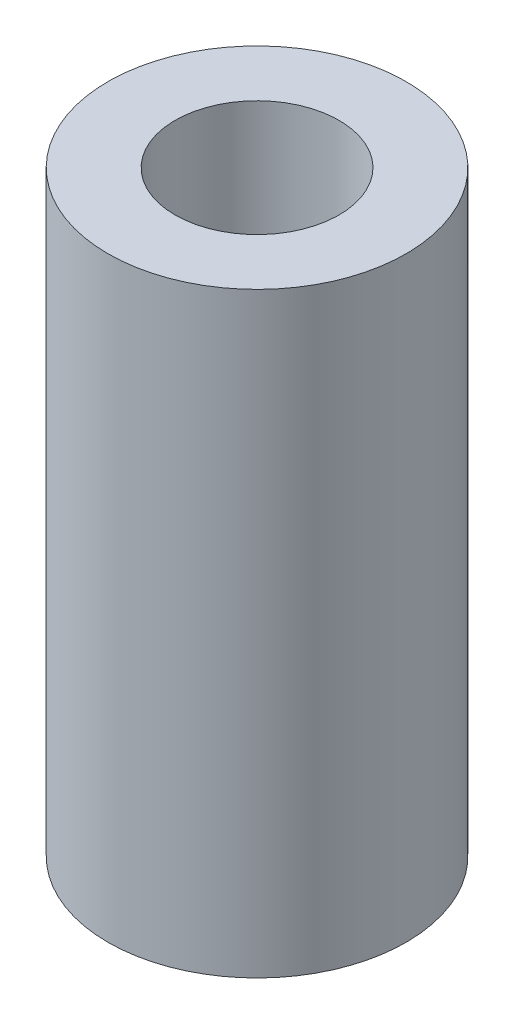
ISO-10303-21;
HEADER;
FILE_DESCRIPTION(('STEP AP214'),'2;1');
FILE_NAME('part.step','',(''),(''),'','','');
FILE_SCHEMA(('AUTOMOTIVE_DESIGN { 1 0 10303 214 1 1 1 1 }'));
ENDSEC;
DATA;
#1=APPLICATION_CONTEXT('core data for automotive mechanical design processes');
#2=APPLICATION_PROTOCOL_DEFINITION('international standard','automotive_design',2000,#1);
#3=PRODUCT_CONTEXT('',#1,'mechanical');
#4=PRODUCT('Part','Part','',(#3));
#5=PRODUCT_RELATED_PRODUCT_CATEGORY('part','',(#4));
#6=PRODUCT_DEFINITION_FORMATION('','',#4);
#7=PRODUCT_DEFINITION_CONTEXT('part definition',#1,'design');
#8=PRODUCT_DEFINITION('design','',#6,#7);
#9=PRODUCT_DEFINITION_SHAPE('','',#8);
#10=(LENGTH_UNIT() NAMED_UNIT(*) SI_UNIT(.MILLI.,.METRE.));
#11=(NAMED_UNIT(*) PLANE_ANGLE_UNIT() SI_UNIT($,.RADIAN.));
#12=(NAMED_UNIT(*) SI_UNIT($,.STERADIAN.) SOLID_ANGLE_UNIT());
#13=UNCERTAINTY_MEASURE_WITH_UNIT(LENGTH_MEASURE(1.E-05),#10,'distance_accuracy_value','');
#14=(GEOMETRIC_REPRESENTATION_CONTEXT(3) GLOBAL_UNCERTAINTY_ASSIGNED_CONTEXT((#13)) GLOBAL_UNIT_ASSIGNED_CONTEXT((#10,
#11,#12)) REPRESENTATION_CONTEXT('',''));
#15=CARTESIAN_POINT('',(0.,0.,0.));
#16=DIRECTION('',(0.,0.,1.));
#17=DIRECTION('',(1.,0.,0.));
#18=AXIS2_PLACEMENT_3D('',#15,#16,#17);
#19=CARTESIAN_POINT('',(0.,20.,0.));
#20=DIRECTION('',(0.,1.,0.));
#21=DIRECTION('',(0.,0.,1.));
#22=AXIS2_PLACEMENT_3D('',#19,#20,#21);
#23=PLANE('',#22);
#24=CARTESIAN_POINT('',(0.,20.,0.));
#25=DIRECTION('',(0.,1.,0.));
#26=DIRECTION('',(0.,0.,1.));
#27=AXIS2_PLACEMENT_3D('',#24,#25,#26);
#28=CIRCLE('',#27,5.);
#29=CARTESIAN_POINT('',(0.,20.,5.));
#30=VERTEX_POINT('',#29);
#31=EDGE_CURVE('E10',#30,#30,#28,.T.);
#32=ORIENTED_EDGE('',*,*,#31,.T.);
#33=EDGE_LOOP('',(#32));
#34=FACE_BOUND('',#33,.T.);
#35=CARTESIAN_POINT('',(0.,20.,0.));
#36=DIRECTION('',(0.,1.,0.));
#37=DIRECTION('',(0.,0.,1.));
#38=AXIS2_PLACEMENT_3D('',#35,#36,#37);
#39=CIRCLE('',#38,2.75);
#40=CARTESIAN_POINT('',(0.,20.,2.75));
#41=VERTEX_POINT('',#40);
#42=EDGE_CURVE('E43',#41,#41,#39,.T.);
#43=ORIENTED_EDGE('',*,*,#42,.F.);
#44=EDGE_LOOP('',(#43));
#45=FACE_BOUND('',#44,.T.);
#46=ADVANCED_FACE('F32',(#34,#45),#23,.T.);
#47=CARTESIAN_POINT('',(0.,0.,0.));
#48=DIRECTION('',(0.,1.,0.));
#49=DIRECTION('',(0.,0.,1.));
#50=AXIS2_PLACEMENT_3D('',#47,#48,#49);
#51=PLANE('',#50);
#52=CARTESIAN_POINT('',(0.,0.,0.));
#53=DIRECTION('',(0.,1.,0.));
#54=DIRECTION('',(0.,0.,1.));
#55=AXIS2_PLACEMENT_3D('',#52,#53,#54);
#56=CIRCLE('',#55,5.);
#57=CARTESIAN_POINT('',(0.,0.,5.));
#58=VERTEX_POINT('',#57);
#59=EDGE_CURVE('E36',#58,#58,#56,.T.);
#60=ORIENTED_EDGE('',*,*,#59,.F.);
#61=EDGE_LOOP('',(#60));
#62=FACE_BOUND('',#61,.T.);
#63=CARTESIAN_POINT('',(0.,0.,0.));
#64=DIRECTION('',(0.,1.,0.));
#65=DIRECTION('',(0.,0.,1.));
#66=AXIS2_PLACEMENT_3D('',#63,#64,#65);
#67=CIRCLE('',#66,2.75);
#68=CARTESIAN_POINT('',(0.,0.,2.75));
#69=VERTEX_POINT('',#68);
#70=EDGE_CURVE('E45',#69,#69,#67,.T.);
#71=ORIENTED_EDGE('',*,*,#70,.T.);
#72=EDGE_LOOP('',(#71));
#73=FACE_BOUND('',#72,.T.);
#74=ADVANCED_FACE('F55',(#62,#73),#51,.F.);
#75=CARTESIAN_POINT('',(0.,20.,0.));
#76=DIRECTION('',(0.,-1.,0.));
#77=DIRECTION('',(0.,0.,-1.));
#78=AXIS2_PLACEMENT_3D('',#75,#76,#77);
#79=CYLINDRICAL_SURFACE('',#78,5.);
#80=ORIENTED_EDGE('',*,*,#31,.F.);
#81=EDGE_LOOP('',(#80));
#82=FACE_BOUND('',#81,.T.);
#83=ORIENTED_EDGE('',*,*,#59,.T.);
#84=EDGE_LOOP('',(#83));
#85=FACE_BOUND('',#84,.T.);
#86=ADVANCED_FACE('F34',(#82,#85),#79,.T.);
#87=CARTESIAN_POINT('',(0.,20.,0.));
#88=DIRECTION('',(0.,-1.,0.));
#89=DIRECTION('',(0.,0.,-1.));
#90=AXIS2_PLACEMENT_3D('',#87,#88,#89);
#91=CYLINDRICAL_SURFACE('',#90,2.75);
#92=ORIENTED_EDGE('',*,*,#42,.T.);
#93=EDGE_LOOP('',(#92));
#94=FACE_BOUND('',#93,.T.);
#95=ORIENTED_EDGE('',*,*,#70,.F.);
#96=EDGE_LOOP('',(#95));
#97=FACE_BOUND('',#96,.T.);
#98=ADVANCED_FACE('F51',(#94,#97),#91,.F.);
#99=CLOSED_SHELL('',(#46,#74,#86,#98));
#100=MANIFOLD_SOLID_BREP('B2',#99);
#101=ADVANCED_BREP_SHAPE_REPRESENTATION('',(#18,#100),#14);
#102=SHAPE_DEFINITION_REPRESENTATION(#9,#101);
ENDSEC;
END-ISO-10303-21;
